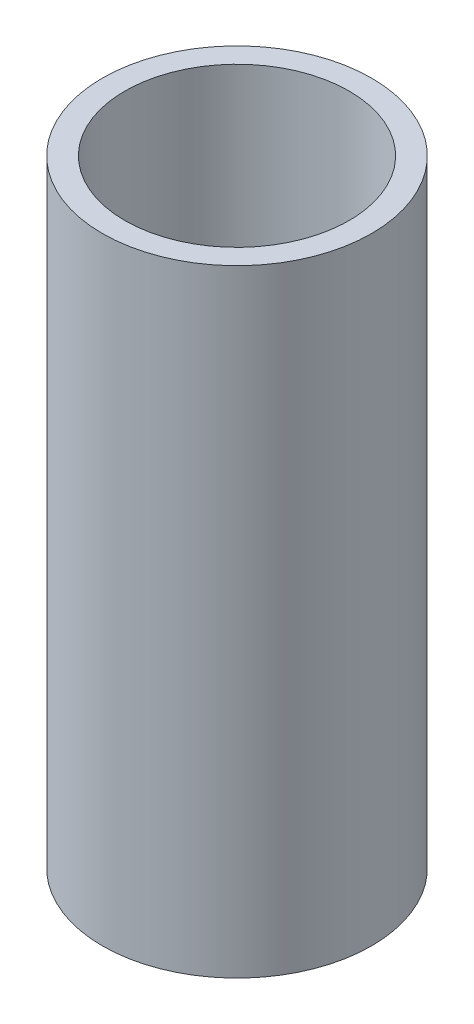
ISO-10303-21;
HEADER;
FILE_DESCRIPTION(('STEP AP214'),'2;1');
FILE_NAME('part.step','',(''),(''),'','','');
FILE_SCHEMA(('AUTOMOTIVE_DESIGN { 1 0 10303 214 1 1 1 1 }'));
ENDSEC;
DATA;
#1=APPLICATION_CONTEXT('core data for automotive mechanical design processes');
#2=APPLICATION_PROTOCOL_DEFINITION('international standard','automotive_design',2000,#1);
#3=PRODUCT_CONTEXT('',#1,'mechanical');
#4=PRODUCT('Part','Part','',(#3));
#5=PRODUCT_RELATED_PRODUCT_CATEGORY('part','',(#4));
#6=PRODUCT_DEFINITION_FORMATION('','',#4);
#7=PRODUCT_DEFINITION_CONTEXT('part definition',#1,'design');
#8=PRODUCT_DEFINITION('design','',#6,#7);
#9=PRODUCT_DEFINITION_SHAPE('','',#8);
#10=(LENGTH_UNIT() NAMED_UNIT(*) SI_UNIT(.MILLI.,.METRE.));
#11=(NAMED_UNIT(*) PLANE_ANGLE_UNIT() SI_UNIT($,.RADIAN.));
#12=(NAMED_UNIT(*) SI_UNIT($,.STERADIAN.) SOLID_ANGLE_UNIT());
#13=UNCERTAINTY_MEASURE_WITH_UNIT(LENGTH_MEASURE(1.E-05),#10,'distance_accuracy_value','');
#14=(GEOMETRIC_REPRESENTATION_CONTEXT(3) GLOBAL_UNCERTAINTY_ASSIGNED_CONTEXT((#13)) GLOBAL_UNIT_ASSIGNED_CONTEXT((#10,
#11,#12)) REPRESENTATION_CONTEXT('',''));
#15=CARTESIAN_POINT('',(0.,0.,0.));
#16=DIRECTION('',(0.,0.,1.));
#17=DIRECTION('',(1.,0.,0.));
#18=AXIS2_PLACEMENT_3D('',#15,#16,#17);
#19=CARTESIAN_POINT('',(0.,0.,0.));
#20=DIRECTION('',(0.,-1.,0.));
#21=DIRECTION('',(0.,0.,-1.));
#22=AXIS2_PLACEMENT_3D('',#19,#20,#21);
#23=CYLINDRICAL_SURFACE('',#22,5.);
#24=CARTESIAN_POINT('',(0.,0.,0.));
#25=DIRECTION('',(0.,-1.,0.));
#26=DIRECTION('',(0.,0.,-1.));
#27=AXIS2_PLACEMENT_3D('',#24,#25,#26);
#28=CIRCLE('',#27,5.);
#29=CARTESIAN_POINT('',(0.,0.,-5.));
#30=VERTEX_POINT('',#29);
#31=EDGE_CURVE('E54',#30,#30,#28,.T.);
#32=ORIENTED_EDGE('',*,*,#31,.T.);
#33=EDGE_LOOP('',(#32));
#34=FACE_BOUND('',#33,.T.);
#35=CARTESIAN_POINT('',(0.,27.5,0.));
#36=DIRECTION('',(0.,-1.,0.));
#37=DIRECTION('',(0.,0.,-1.));
#38=AXIS2_PLACEMENT_3D('',#35,#36,#37);
#39=CIRCLE('',#38,5.);
#40=CARTESIAN_POINT('',(0.,27.5,-5.));
#41=VERTEX_POINT('',#40);
#42=EDGE_CURVE('E10',#41,#41,#39,.T.);
#43=ORIENTED_EDGE('',*,*,#42,.F.);
#44=EDGE_LOOP('',(#43));
#45=FACE_BOUND('',#44,.T.);
#46=ADVANCED_FACE('F37',(#34,#45),#23,.F.);
#47=CARTESIAN_POINT('',(5.,27.5,0.));
#48=DIRECTION('',(0.,1.,0.));
#49=DIRECTION('',(0.,0.,1.));
#50=AXIS2_PLACEMENT_3D('',#47,#48,#49);
#51=PLANE('',#50);
#52=ORIENTED_EDGE('',*,*,#42,.T.);
#53=EDGE_LOOP('',(#52));
#54=FACE_BOUND('',#53,.T.);
#55=CARTESIAN_POINT('',(0.,27.5,0.));
#56=DIRECTION('',(0.,-1.,0.));
#57=DIRECTION('',(0.,0.,-1.));
#58=AXIS2_PLACEMENT_3D('',#55,#56,#57);
#59=CIRCLE('',#58,6.);
#60=CARTESIAN_POINT('',(0.,27.5,-6.));
#61=VERTEX_POINT('',#60);
#62=EDGE_CURVE('E44',#61,#61,#59,.T.);
#63=ORIENTED_EDGE('',*,*,#62,.F.);
#64=EDGE_LOOP('',(#63));
#65=FACE_BOUND('',#64,.T.);
#66=ADVANCED_FACE('F71',(#54,#65),#51,.T.);
#67=CARTESIAN_POINT('',(0.,0.,0.));
#68=DIRECTION('',(0.,-1.,0.));
#69=DIRECTION('',(0.,0.,-1.));
#70=AXIS2_PLACEMENT_3D('',#67,#68,#69);
#71=CYLINDRICAL_SURFACE('',#70,6.);
#72=ORIENTED_EDGE('',*,*,#62,.T.);
#73=EDGE_LOOP('',(#72));
#74=FACE_BOUND('',#73,.T.);
#75=CARTESIAN_POINT('',(0.,0.,0.));
#76=DIRECTION('',(0.,-1.,0.));
#77=DIRECTION('',(0.,0.,-1.));
#78=AXIS2_PLACEMENT_3D('',#75,#76,#77);
#79=CIRCLE('',#78,6.);
#80=CARTESIAN_POINT('',(0.,0.,-6.));
#81=VERTEX_POINT('',#80);
#82=EDGE_CURVE('E49',#81,#81,#79,.T.);
#83=ORIENTED_EDGE('',*,*,#82,.F.);
#84=EDGE_LOOP('',(#83));
#85=FACE_BOUND('',#84,.T.);
#86=ADVANCED_FACE('F65',(#74,#85),#71,.T.);
#87=CARTESIAN_POINT('',(5.,0.,0.));
#88=DIRECTION('',(0.,-1.,0.));
#89=DIRECTION('',(0.,0.,-1.));
#90=AXIS2_PLACEMENT_3D('',#87,#88,#89);
#91=PLANE('',#90);
#92=ORIENTED_EDGE('',*,*,#82,.T.);
#93=EDGE_LOOP('',(#92));
#94=FACE_BOUND('',#93,.T.);
#95=ORIENTED_EDGE('',*,*,#31,.F.);
#96=EDGE_LOOP('',(#95));
#97=FACE_BOUND('',#96,.T.);
#98=ADVANCED_FACE('F63',(#94,#97),#91,.T.);
#99=CLOSED_SHELL('',(#46,#66,#86,#98));
#100=MANIFOLD_SOLID_BREP('B2',#99);
#101=ADVANCED_BREP_SHAPE_REPRESENTATION('',(#18,#100),#14);
#102=SHAPE_DEFINITION_REPRESENTATION(#9,#101);
ENDSEC;
END-ISO-10303-21;
